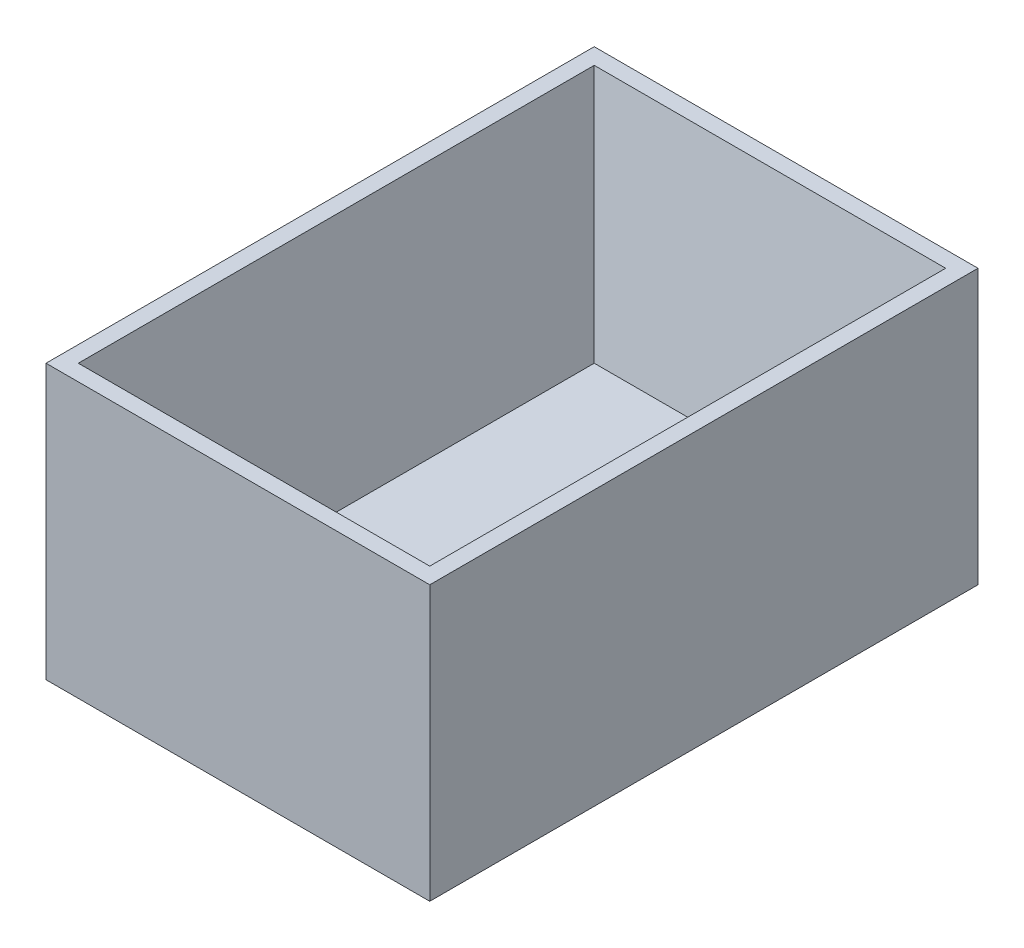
ISO-10303-21;
HEADER;
FILE_DESCRIPTION(('STEP AP214'),'2;1');
FILE_NAME('part.step','',(''),(''),'','','');
FILE_SCHEMA(('AUTOMOTIVE_DESIGN { 1 0 10303 214 1 1 1 1 }'));
ENDSEC;
DATA;
#1=APPLICATION_CONTEXT('core data for automotive mechanical design processes');
#2=APPLICATION_PROTOCOL_DEFINITION('international standard','automotive_design',2000,#1);
#3=PRODUCT_CONTEXT('',#1,'mechanical');
#4=PRODUCT('Part','Part','',(#3));
#5=PRODUCT_RELATED_PRODUCT_CATEGORY('part','',(#4));
#6=PRODUCT_DEFINITION_FORMATION('','',#4);
#7=PRODUCT_DEFINITION_CONTEXT('part definition',#1,'design');
#8=PRODUCT_DEFINITION('design','',#6,#7);
#9=PRODUCT_DEFINITION_SHAPE('','',#8);
#10=(LENGTH_UNIT() NAMED_UNIT(*) SI_UNIT(.MILLI.,.METRE.));
#11=(NAMED_UNIT(*) PLANE_ANGLE_UNIT() SI_UNIT($,.RADIAN.));
#12=(NAMED_UNIT(*) SI_UNIT($,.STERADIAN.) SOLID_ANGLE_UNIT());
#13=UNCERTAINTY_MEASURE_WITH_UNIT(LENGTH_MEASURE(1.E-05),#10,'distance_accuracy_value','');
#14=(GEOMETRIC_REPRESENTATION_CONTEXT(3) GLOBAL_UNCERTAINTY_ASSIGNED_CONTEXT((#13)) GLOBAL_UNIT_ASSIGNED_CONTEXT((#10,
#11,#12)) REPRESENTATION_CONTEXT('',''));
#15=CARTESIAN_POINT('',(0.,0.,0.));
#16=DIRECTION('',(0.,0.,1.));
#17=DIRECTION('',(1.,0.,0.));
#18=AXIS2_PLACEMENT_3D('',#15,#16,#17);
#19=CARTESIAN_POINT('',(0.,50.,0.));
#20=DIRECTION('',(1.,0.,0.));
#21=DIRECTION('',(0.,0.,-1.));
#22=AXIS2_PLACEMENT_3D('',#19,#20,#21);
#23=PLANE('',#22);
#24=DIRECTION('',(0.,0.,1.));
#25=VECTOR('',#24,1.);
#26=CARTESIAN_POINT('',(0.,0.,0.));
#27=LINE('',#26,#25);
#28=CARTESIAN_POINT('',(0.,0.,0.));
#29=VERTEX_POINT('',#28);
#30=CARTESIAN_POINT('',(0.,0.,100.));
#31=VERTEX_POINT('',#30);
#32=EDGE_CURVE('E108',#29,#31,#27,.T.);
#33=ORIENTED_EDGE('',*,*,#32,.T.);
#34=DIRECTION('',(0.,-1.,0.));
#35=VECTOR('',#34,1.);
#36=CARTESIAN_POINT('',(0.,50.,100.));
#37=LINE('',#36,#35);
#38=CARTESIAN_POINT('',(0.,50.,100.));
#39=VERTEX_POINT('',#38);
#40=EDGE_CURVE('E11',#39,#31,#37,.T.);
#41=ORIENTED_EDGE('',*,*,#40,.F.);
#42=DIRECTION('',(0.,0.,1.));
#43=VECTOR('',#42,1.);
#44=CARTESIAN_POINT('',(0.,50.,0.));
#45=LINE('',#44,#43);
#46=CARTESIAN_POINT('',(0.,50.,0.));
#47=VERTEX_POINT('',#46);
#48=EDGE_CURVE('E124',#47,#39,#45,.T.);
#49=ORIENTED_EDGE('',*,*,#48,.F.);
#50=DIRECTION('',(0.,-1.,0.));
#51=VECTOR('',#50,1.);
#52=CARTESIAN_POINT('',(0.,50.,0.));
#53=LINE('',#52,#51);
#54=EDGE_CURVE('E117',#47,#29,#53,.T.);
#55=ORIENTED_EDGE('',*,*,#54,.T.);
#56=EDGE_LOOP('',(#33,#41,#49,#55));
#57=FACE_BOUND('',#56,.T.);
#58=ADVANCED_FACE('F36',(#57),#23,.F.);
#59=CARTESIAN_POINT('',(0.,50.,100.));
#60=DIRECTION('',(0.,0.,-1.));
#61=DIRECTION('',(-1.,0.,0.));
#62=AXIS2_PLACEMENT_3D('',#59,#60,#61);
#63=PLANE('',#62);
#64=DIRECTION('',(1.,0.,0.));
#65=VECTOR('',#64,1.);
#66=CARTESIAN_POINT('',(0.,0.,100.));
#67=LINE('',#66,#65);
#68=CARTESIAN_POINT('',(70.,0.,100.));
#69=VERTEX_POINT('',#68);
#70=EDGE_CURVE('E128',#31,#69,#67,.T.);
#71=ORIENTED_EDGE('',*,*,#70,.T.);
#72=DIRECTION('',(0.,-1.,0.));
#73=VECTOR('',#72,1.);
#74=CARTESIAN_POINT('',(70.,50.,100.));
#75=LINE('',#74,#73);
#76=CARTESIAN_POINT('',(70.,50.,100.));
#77=VERTEX_POINT('',#76);
#78=EDGE_CURVE('E46',#77,#69,#75,.T.);
#79=ORIENTED_EDGE('',*,*,#78,.F.);
#80=DIRECTION('',(1.,0.,0.));
#81=VECTOR('',#80,1.);
#82=CARTESIAN_POINT('',(0.,50.,100.));
#83=LINE('',#82,#81);
#84=EDGE_CURVE('E137',#39,#77,#83,.T.);
#85=ORIENTED_EDGE('',*,*,#84,.F.);
#86=ORIENTED_EDGE('',*,*,#40,.T.);
#87=EDGE_LOOP('',(#71,#79,#85,#86));
#88=FACE_BOUND('',#87,.T.);
#89=ADVANCED_FACE('F182',(#88),#63,.F.);
#90=CARTESIAN_POINT('',(70.,50.,0.));
#91=DIRECTION('',(-1.,0.,0.));
#92=DIRECTION('',(0.,0.,1.));
#93=AXIS2_PLACEMENT_3D('',#90,#91,#92);
#94=PLANE('',#93);
#95=DIRECTION('',(0.,0.,-1.));
#96=VECTOR('',#95,1.);
#97=CARTESIAN_POINT('',(70.,0.,0.));
#98=LINE('',#97,#96);
#99=CARTESIAN_POINT('',(70.,0.,0.));
#100=VERTEX_POINT('',#99);
#101=EDGE_CURVE('E125',#69,#100,#98,.T.);
#102=ORIENTED_EDGE('',*,*,#101,.T.);
#103=DIRECTION('',(0.,-1.,0.));
#104=VECTOR('',#103,1.);
#105=CARTESIAN_POINT('',(70.,50.,0.));
#106=LINE('',#105,#104);
#107=CARTESIAN_POINT('',(70.,50.,0.));
#108=VERTEX_POINT('',#107);
#109=EDGE_CURVE('E114',#108,#100,#106,.T.);
#110=ORIENTED_EDGE('',*,*,#109,.F.);
#111=DIRECTION('',(0.,0.,-1.));
#112=VECTOR('',#111,1.);
#113=CARTESIAN_POINT('',(70.,50.,0.));
#114=LINE('',#113,#112);
#115=EDGE_CURVE('E134',#77,#108,#114,.T.);
#116=ORIENTED_EDGE('',*,*,#115,.F.);
#117=ORIENTED_EDGE('',*,*,#78,.T.);
#118=EDGE_LOOP('',(#102,#110,#116,#117));
#119=FACE_BOUND('',#118,.T.);
#120=ADVANCED_FACE('F184',(#119),#94,.F.);
#121=CARTESIAN_POINT('',(0.,50.,0.));
#122=DIRECTION('',(0.,0.,1.));
#123=DIRECTION('',(1.,0.,0.));
#124=AXIS2_PLACEMENT_3D('',#121,#122,#123);
#125=PLANE('',#124);
#126=DIRECTION('',(-1.,0.,0.));
#127=VECTOR('',#126,1.);
#128=CARTESIAN_POINT('',(0.,0.,0.));
#129=LINE('',#128,#127);
#130=EDGE_CURVE('E121',#100,#29,#129,.T.);
#131=ORIENTED_EDGE('',*,*,#130,.T.);
#132=ORIENTED_EDGE('',*,*,#54,.F.);
#133=DIRECTION('',(-1.,0.,0.));
#134=VECTOR('',#133,1.);
#135=CARTESIAN_POINT('',(0.,50.,0.));
#136=LINE('',#135,#134);
#137=EDGE_CURVE('E120',#108,#47,#136,.T.);
#138=ORIENTED_EDGE('',*,*,#137,.F.);
#139=ORIENTED_EDGE('',*,*,#109,.T.);
#140=EDGE_LOOP('',(#131,#132,#138,#139));
#141=FACE_BOUND('',#140,.T.);
#142=ADVANCED_FACE('F172',(#141),#125,.F.);
#143=CARTESIAN_POINT('',(0.,50.,0.));
#144=DIRECTION('',(0.,1.,0.));
#145=DIRECTION('',(0.,0.,1.));
#146=AXIS2_PLACEMENT_3D('',#143,#144,#145);
#147=PLANE('',#146);
#148=DIRECTION('',(0.,0.,-1.));
#149=VECTOR('',#148,1.);
#150=CARTESIAN_POINT('',(2.94692077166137,50.,0.));
#151=LINE('',#150,#149);
#152=CARTESIAN_POINT('',(2.94692077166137,50.,2.94692077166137));
#153=VERTEX_POINT('',#152);
#154=CARTESIAN_POINT('',(2.94692077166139,50.,97.0530792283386));
#155=VERTEX_POINT('',#154);
#156=EDGE_CURVE('E55',#153,#155,#151,.F.);
#157=ORIENTED_EDGE('',*,*,#156,.F.);
#158=DIRECTION('',(1.,0.,0.));
#159=VECTOR('',#158,1.);
#160=CARTESIAN_POINT('',(0.,50.,2.94692077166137));
#161=LINE('',#160,#159);
#162=CARTESIAN_POINT('',(67.0530792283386,50.,2.94692077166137));
#163=VERTEX_POINT('',#162);
#164=EDGE_CURVE('E98',#163,#153,#161,.F.);
#165=ORIENTED_EDGE('',*,*,#164,.F.);
#166=DIRECTION('',(0.,0.,1.));
#167=VECTOR('',#166,1.);
#168=CARTESIAN_POINT('',(67.0530792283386,50.,0.));
#169=LINE('',#168,#167);
#170=CARTESIAN_POINT('',(67.0530792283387,50.,97.0530792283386));
#171=VERTEX_POINT('',#170);
#172=EDGE_CURVE('E40',#171,#163,#169,.F.);
#173=ORIENTED_EDGE('',*,*,#172,.F.);
#174=DIRECTION('',(-1.,0.,0.));
#175=VECTOR('',#174,1.);
#176=CARTESIAN_POINT('',(0.,50.,97.0530792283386));
#177=LINE('',#176,#175);
#178=EDGE_CURVE('E92',#155,#171,#177,.F.);
#179=ORIENTED_EDGE('',*,*,#178,.F.);
#180=EDGE_LOOP('',(#157,#165,#173,#179));
#181=FACE_BOUND('',#180,.T.);
#182=ORIENTED_EDGE('',*,*,#48,.T.);
#183=ORIENTED_EDGE('',*,*,#84,.T.);
#184=ORIENTED_EDGE('',*,*,#115,.T.);
#185=ORIENTED_EDGE('',*,*,#137,.T.);
#186=EDGE_LOOP('',(#182,#183,#184,#185));
#187=FACE_BOUND('',#186,.T.);
#188=ADVANCED_FACE('F96',(#181,#187),#147,.T.);
#189=CARTESIAN_POINT('',(0.,0.,0.));
#190=DIRECTION('',(0.,1.,0.));
#191=DIRECTION('',(0.,0.,1.));
#192=AXIS2_PLACEMENT_3D('',#189,#190,#191);
#193=PLANE('',#192);
#194=ORIENTED_EDGE('',*,*,#32,.F.);
#195=ORIENTED_EDGE('',*,*,#130,.F.);
#196=ORIENTED_EDGE('',*,*,#101,.F.);
#197=ORIENTED_EDGE('',*,*,#70,.F.);
#198=EDGE_LOOP('',(#194,#195,#196,#197));
#199=FACE_BOUND('',#198,.T.);
#200=ADVANCED_FACE('F179',(#199),#193,.F.);
#201=CARTESIAN_POINT('',(10.,10.,10.));
#202=DIRECTION('',(0.984807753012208,0.173648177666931,0.));
#203=DIRECTION('',(-0.173648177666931,0.984807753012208,0.));
#204=AXIS2_PLACEMENT_3D('',#201,#202,#203);
#205=PLANE('',#204);
#206=ORIENTED_EDGE('',*,*,#156,.T.);
#207=DIRECTION('',(-0.171087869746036,0.970287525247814,0.171087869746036));
#208=VECTOR('',#207,1.);
#209=CARTESIAN_POINT('',(12.3416847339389,-3.28035405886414,87.6583152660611));
#210=LINE('',#209,#208);
#211=CARTESIAN_POINT('',(10.,10.,90.));
#212=VERTEX_POINT('',#211);
#213=EDGE_CURVE('E89',#212,#155,#210,.T.);
#214=ORIENTED_EDGE('',*,*,#213,.F.);
#215=DIRECTION('',(0.,0.,1.));
#216=VECTOR('',#215,1.);
#217=CARTESIAN_POINT('',(10.,10.,10.));
#218=LINE('',#217,#216);
#219=CARTESIAN_POINT('',(10.,10.,10.));
#220=VERTEX_POINT('',#219);
#221=EDGE_CURVE('E99',#220,#212,#218,.T.);
#222=ORIENTED_EDGE('',*,*,#221,.F.);
#223=DIRECTION('',(-0.171087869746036,0.970287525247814,-0.171087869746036));
#224=VECTOR('',#223,1.);
#225=CARTESIAN_POINT('',(10.,10.,10.));
#226=LINE('',#225,#224);
#227=EDGE_CURVE('E106',#220,#153,#226,.T.);
#228=ORIENTED_EDGE('',*,*,#227,.T.);
#229=EDGE_LOOP('',(#206,#214,#222,#228));
#230=FACE_BOUND('',#229,.T.);
#231=ADVANCED_FACE('F38',(#230),#205,.T.);
#232=CARTESIAN_POINT('',(10.,10.,10.));
#233=DIRECTION('',(0.,0.173648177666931,0.984807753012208));
#234=DIRECTION('',(0.,-0.984807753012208,0.173648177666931));
#235=AXIS2_PLACEMENT_3D('',#232,#233,#234);
#236=PLANE('',#235);
#237=ORIENTED_EDGE('',*,*,#164,.T.);
#238=ORIENTED_EDGE('',*,*,#227,.F.);
#239=DIRECTION('',(-1.,0.,0.));
#240=VECTOR('',#239,1.);
#241=CARTESIAN_POINT('',(10.,10.,10.));
#242=LINE('',#241,#240);
#243=CARTESIAN_POINT('',(60.,10.,10.));
#244=VERTEX_POINT('',#243);
#245=EDGE_CURVE('E110',#244,#220,#242,.T.);
#246=ORIENTED_EDGE('',*,*,#245,.F.);
#247=DIRECTION('',(0.171087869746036,0.970287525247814,-0.171087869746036));
#248=VECTOR('',#247,1.);
#249=CARTESIAN_POINT('',(60.,10.,10.));
#250=LINE('',#249,#248);
#251=EDGE_CURVE('E72',#244,#163,#250,.T.);
#252=ORIENTED_EDGE('',*,*,#251,.T.);
#253=EDGE_LOOP('',(#237,#238,#246,#252));
#254=FACE_BOUND('',#253,.T.);
#255=ADVANCED_FACE('F201',(#254),#236,.T.);
#256=CARTESIAN_POINT('',(60.,10.,10.));
#257=DIRECTION('',(-0.984807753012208,0.173648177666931,0.));
#258=DIRECTION('',(-0.173648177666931,-0.984807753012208,0.));
#259=AXIS2_PLACEMENT_3D('',#256,#257,#258);
#260=PLANE('',#259);
#261=ORIENTED_EDGE('',*,*,#172,.T.);
#262=ORIENTED_EDGE('',*,*,#251,.F.);
#263=DIRECTION('',(0.,0.,-1.));
#264=VECTOR('',#263,1.);
#265=CARTESIAN_POINT('',(60.,10.,10.));
#266=LINE('',#265,#264);
#267=CARTESIAN_POINT('',(60.,10.,90.));
#268=VERTEX_POINT('',#267);
#269=EDGE_CURVE('E85',#268,#244,#266,.T.);
#270=ORIENTED_EDGE('',*,*,#269,.F.);
#271=DIRECTION('',(0.171087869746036,0.970287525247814,0.171087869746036));
#272=VECTOR('',#271,1.);
#273=CARTESIAN_POINT('',(58.5364470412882,1.69977871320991,88.5364470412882));
#274=LINE('',#273,#272);
#275=EDGE_CURVE('E78',#268,#171,#274,.T.);
#276=ORIENTED_EDGE('',*,*,#275,.T.);
#277=EDGE_LOOP('',(#261,#262,#270,#276));
#278=FACE_BOUND('',#277,.T.);
#279=ADVANCED_FACE('F80',(#278),#260,.T.);
#280=CARTESIAN_POINT('',(10.,10.,90.));
#281=DIRECTION('',(0.,0.173648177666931,-0.984807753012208));
#282=DIRECTION('',(0.,0.984807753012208,0.173648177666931));
#283=AXIS2_PLACEMENT_3D('',#280,#281,#282);
#284=PLANE('',#283);
#285=ORIENTED_EDGE('',*,*,#178,.T.);
#286=ORIENTED_EDGE('',*,*,#275,.F.);
#287=DIRECTION('',(1.,0.,0.));
#288=VECTOR('',#287,1.);
#289=CARTESIAN_POINT('',(10.,10.,90.));
#290=LINE('',#289,#288);
#291=EDGE_CURVE('E102',#212,#268,#290,.T.);
#292=ORIENTED_EDGE('',*,*,#291,.F.);
#293=ORIENTED_EDGE('',*,*,#213,.T.);
#294=EDGE_LOOP('',(#285,#286,#292,#293));
#295=FACE_BOUND('',#294,.T.);
#296=ADVANCED_FACE('F93',(#295),#284,.T.);
#297=CARTESIAN_POINT('',(0.,10.,0.));
#298=DIRECTION('',(0.,1.,0.));
#299=DIRECTION('',(0.,0.,1.));
#300=AXIS2_PLACEMENT_3D('',#297,#298,#299);
#301=PLANE('',#300);
#302=ORIENTED_EDGE('',*,*,#221,.T.);
#303=ORIENTED_EDGE('',*,*,#291,.T.);
#304=ORIENTED_EDGE('',*,*,#269,.T.);
#305=ORIENTED_EDGE('',*,*,#245,.T.);
#306=EDGE_LOOP('',(#302,#303,#304,#305));
#307=FACE_BOUND('',#306,.T.);
#308=ADVANCED_FACE('F146',(#307),#301,.T.);
#309=CLOSED_SHELL('',(#58,#89,#120,#142,#188,#200,#231,#255,#279,#296,#308));
#310=MANIFOLD_SOLID_BREP('B2',#309);
#311=ADVANCED_BREP_SHAPE_REPRESENTATION('',(#18,#310),#14);
#312=SHAPE_DEFINITION_REPRESENTATION(#9,#311);
ENDSEC;
END-ISO-10303-21;
